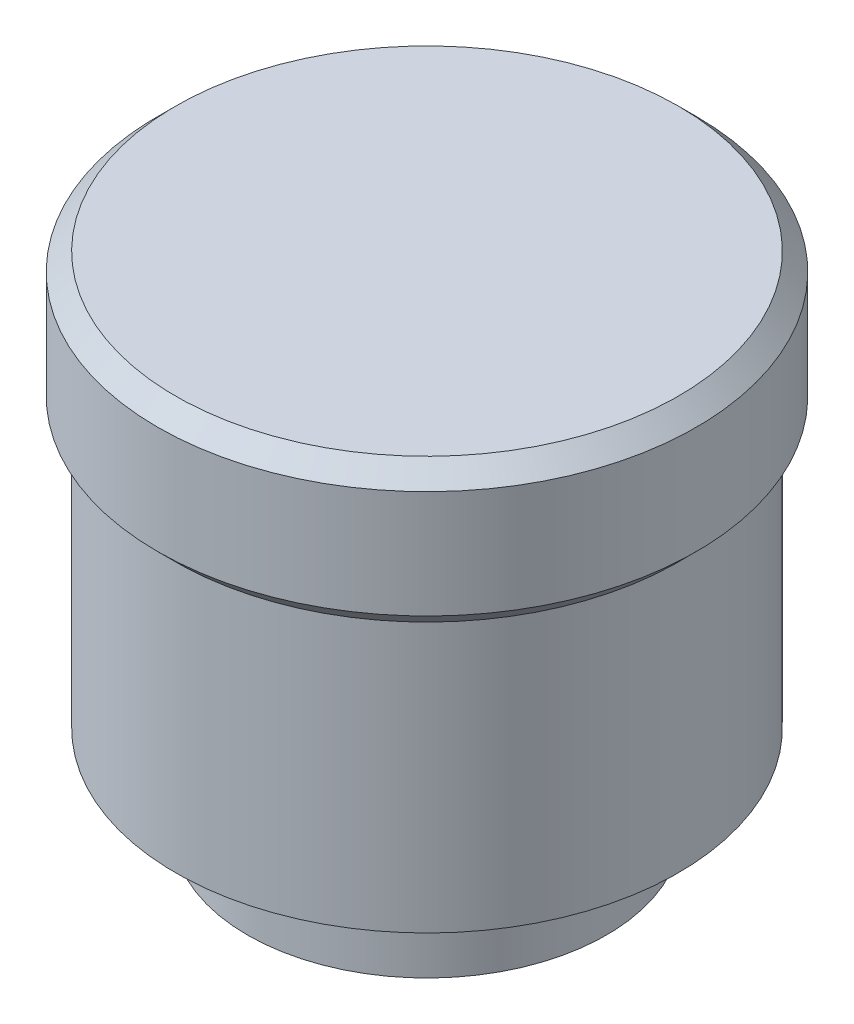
ISO-10303-21;
HEADER;
FILE_DESCRIPTION(('STEP AP214'),'2;1');
FILE_NAME('part.step','',(''),(''),'','','');
FILE_SCHEMA(('AUTOMOTIVE_DESIGN { 1 0 10303 214 1 1 1 1 }'));
ENDSEC;
DATA;
#1=APPLICATION_CONTEXT('core data for automotive mechanical design processes');
#2=APPLICATION_PROTOCOL_DEFINITION('international standard','automotive_design',2000,#1);
#3=PRODUCT_CONTEXT('',#1,'mechanical');
#4=PRODUCT('Part','Part','',(#3));
#5=PRODUCT_RELATED_PRODUCT_CATEGORY('part','',(#4));
#6=PRODUCT_DEFINITION_FORMATION('','',#4);
#7=PRODUCT_DEFINITION_CONTEXT('part definition',#1,'design');
#8=PRODUCT_DEFINITION('design','',#6,#7);
#9=PRODUCT_DEFINITION_SHAPE('','',#8);
#10=(LENGTH_UNIT() NAMED_UNIT(*) SI_UNIT(.MILLI.,.METRE.));
#11=(NAMED_UNIT(*) PLANE_ANGLE_UNIT() SI_UNIT($,.RADIAN.));
#12=(NAMED_UNIT(*) SI_UNIT($,.STERADIAN.) SOLID_ANGLE_UNIT());
#13=UNCERTAINTY_MEASURE_WITH_UNIT(LENGTH_MEASURE(1.E-05),#10,'distance_accuracy_value','');
#14=(GEOMETRIC_REPRESENTATION_CONTEXT(3) GLOBAL_UNCERTAINTY_ASSIGNED_CONTEXT((#13)) GLOBAL_UNIT_ASSIGNED_CONTEXT((#10,
#11,#12)) REPRESENTATION_CONTEXT('',''));
#15=CARTESIAN_POINT('',(0.,0.,0.));
#16=DIRECTION('',(0.,0.,1.));
#17=DIRECTION('',(1.,0.,0.));
#18=AXIS2_PLACEMENT_3D('',#15,#16,#17);
#19=CARTESIAN_POINT('',(0.,0.,-10.));
#20=DIRECTION('',(0.,-1.,0.));
#21=DIRECTION('',(0.,0.,-1.));
#22=AXIS2_PLACEMENT_3D('',#19,#20,#21);
#23=PLANE('',#22);
#24=CARTESIAN_POINT('',(0.,0.,-4.));
#25=DIRECTION('',(0.,-1.,0.));
#26=DIRECTION('',(0.,0.,-1.));
#27=AXIS2_PLACEMENT_3D('',#24,#25,#26);
#28=CIRCLE('',#27,1.65);
#29=CARTESIAN_POINT('',(0.,0.,-5.65));
#30=VERTEX_POINT('',#29);
#31=EDGE_CURVE('E54',#30,#30,#28,.T.);
#32=ORIENTED_EDGE('',*,*,#31,.F.);
#33=EDGE_LOOP('',(#32));
#34=FACE_BOUND('',#33,.T.);
#35=CARTESIAN_POINT('',(0.,0.,0.));
#36=DIRECTION('',(0.,-1.,0.));
#37=DIRECTION('',(0.,0.,-1.));
#38=AXIS2_PLACEMENT_3D('',#35,#36,#37);
#39=CIRCLE('',#38,10.);
#40=CARTESIAN_POINT('',(0.,0.,-10.));
#41=VERTEX_POINT('',#40);
#42=EDGE_CURVE('E53',#41,#41,#39,.T.);
#43=ORIENTED_EDGE('',*,*,#42,.T.);
#44=EDGE_LOOP('',(#43));
#45=FACE_BOUND('',#44,.T.);
#46=ADVANCED_FACE('F34',(#34,#45),#23,.T.);
#47=CARTESIAN_POINT('',(0.,28.,0.));
#48=DIRECTION('',(0.,1.,0.));
#49=DIRECTION('',(0.,0.,1.));
#50=AXIS2_PLACEMENT_3D('',#47,#48,#49);
#51=PLANE('',#50);
#52=CARTESIAN_POINT('',(0.,28.,0.));
#53=DIRECTION('',(0.,-1.,0.));
#54=DIRECTION('',(0.,0.,-1.));
#55=AXIS2_PLACEMENT_3D('',#52,#53,#54);
#56=CIRCLE('',#55,14.);
#57=CARTESIAN_POINT('',(0.,28.,-14.));
#58=VERTEX_POINT('',#57);
#59=EDGE_CURVE('E11',#58,#58,#56,.T.);
#60=ORIENTED_EDGE('',*,*,#59,.F.);
#61=EDGE_LOOP('',(#60));
#62=FACE_BOUND('',#61,.T.);
#63=ADVANCED_FACE('F80',(#62),#51,.T.);
#64=CARTESIAN_POINT('',(0.,27.,0.));
#65=DIRECTION('',(0.,-1.,0.));
#66=DIRECTION('',(0.,0.,-1.));
#67=AXIS2_PLACEMENT_3D('',#64,#65,#66);
#68=CONICAL_SURFACE('',#67,15.,0.785398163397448);
#69=ORIENTED_EDGE('',*,*,#59,.T.);
#70=EDGE_LOOP('',(#69));
#71=FACE_BOUND('',#70,.T.);
#72=CARTESIAN_POINT('',(0.,27.,0.));
#73=DIRECTION('',(0.,-1.,0.));
#74=DIRECTION('',(0.,0.,-1.));
#75=AXIS2_PLACEMENT_3D('',#72,#73,#74);
#76=CIRCLE('',#75,15.);
#77=CARTESIAN_POINT('',(0.,27.,-15.));
#78=VERTEX_POINT('',#77);
#79=EDGE_CURVE('E40',#78,#78,#76,.T.);
#80=ORIENTED_EDGE('',*,*,#79,.F.);
#81=EDGE_LOOP('',(#80));
#82=FACE_BOUND('',#81,.T.);
#83=ADVANCED_FACE('F78',(#71,#82),#68,.T.);
#84=CARTESIAN_POINT('',(0.,0.,0.));
#85=DIRECTION('',(0.,-1.,0.));
#86=DIRECTION('',(0.,0.,-1.));
#87=AXIS2_PLACEMENT_3D('',#84,#85,#86);
#88=CYLINDRICAL_SURFACE('',#87,15.);
#89=ORIENTED_EDGE('',*,*,#79,.T.);
#90=EDGE_LOOP('',(#89));
#91=FACE_BOUND('',#90,.T.);
#92=CARTESIAN_POINT('',(0.,21.,0.));
#93=DIRECTION('',(0.,-1.,0.));
#94=DIRECTION('',(0.,0.,-1.));
#95=AXIS2_PLACEMENT_3D('',#92,#93,#94);
#96=CIRCLE('',#95,15.);
#97=CARTESIAN_POINT('',(0.,21.,-15.));
#98=VERTEX_POINT('',#97);
#99=EDGE_CURVE('E70',#98,#98,#96,.T.);
#100=ORIENTED_EDGE('',*,*,#99,.F.);
#101=EDGE_LOOP('',(#100));
#102=FACE_BOUND('',#101,.T.);
#103=ADVANCED_FACE('F75',(#91,#102),#88,.T.);
#104=CARTESIAN_POINT('',(0.,20.,0.));
#105=DIRECTION('',(0.,1.,0.));
#106=DIRECTION('',(0.,0.,1.));
#107=AXIS2_PLACEMENT_3D('',#104,#105,#106);
#108=CONICAL_SURFACE('',#107,14.,0.785398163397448);
#109=ORIENTED_EDGE('',*,*,#99,.T.);
#110=EDGE_LOOP('',(#109));
#111=FACE_BOUND('',#110,.T.);
#112=CARTESIAN_POINT('',(0.,20.,0.));
#113=DIRECTION('',(0.,-1.,0.));
#114=DIRECTION('',(0.,0.,-1.));
#115=AXIS2_PLACEMENT_3D('',#112,#113,#114);
#116=CIRCLE('',#115,14.);
#117=CARTESIAN_POINT('',(0.,20.,-14.));
#118=VERTEX_POINT('',#117);
#119=EDGE_CURVE('E67',#118,#118,#116,.T.);
#120=ORIENTED_EDGE('',*,*,#119,.F.);
#121=EDGE_LOOP('',(#120));
#122=FACE_BOUND('',#121,.T.);
#123=ADVANCED_FACE('F87',(#111,#122),#108,.T.);
#124=CARTESIAN_POINT('',(0.,0.,0.));
#125=DIRECTION('',(0.,-1.,0.));
#126=DIRECTION('',(0.,0.,-1.));
#127=AXIS2_PLACEMENT_3D('',#124,#125,#126);
#128=CYLINDRICAL_SURFACE('',#127,14.);
#129=ORIENTED_EDGE('',*,*,#119,.T.);
#130=EDGE_LOOP('',(#129));
#131=FACE_BOUND('',#130,.T.);
#132=CARTESIAN_POINT('',(0.,5.,0.));
#133=DIRECTION('',(0.,-1.,0.));
#134=DIRECTION('',(0.,0.,-1.));
#135=AXIS2_PLACEMENT_3D('',#132,#133,#134);
#136=CIRCLE('',#135,14.);
#137=CARTESIAN_POINT('',(0.,5.,-14.));
#138=VERTEX_POINT('',#137);
#139=EDGE_CURVE('E64',#138,#138,#136,.T.);
#140=ORIENTED_EDGE('',*,*,#139,.F.);
#141=EDGE_LOOP('',(#140));
#142=FACE_BOUND('',#141,.T.);
#143=ADVANCED_FACE('F105',(#131,#142),#128,.T.);
#144=CARTESIAN_POINT('',(0.,5.,-14.));
#145=DIRECTION('',(0.,-1.,0.));
#146=DIRECTION('',(0.,0.,-1.));
#147=AXIS2_PLACEMENT_3D('',#144,#145,#146);
#148=PLANE('',#147);
#149=ORIENTED_EDGE('',*,*,#139,.T.);
#150=EDGE_LOOP('',(#149));
#151=FACE_BOUND('',#150,.T.);
#152=CARTESIAN_POINT('',(0.,5.,0.));
#153=DIRECTION('',(0.,-1.,0.));
#154=DIRECTION('',(0.,0.,-1.));
#155=AXIS2_PLACEMENT_3D('',#152,#153,#154);
#156=CIRCLE('',#155,10.);
#157=CARTESIAN_POINT('',(0.,5.,-10.));
#158=VERTEX_POINT('',#157);
#159=EDGE_CURVE('E57',#158,#158,#156,.T.);
#160=ORIENTED_EDGE('',*,*,#159,.F.);
#161=EDGE_LOOP('',(#160));
#162=FACE_BOUND('',#161,.T.);
#163=ADVANCED_FACE('F99',(#151,#162),#148,.T.);
#164=CARTESIAN_POINT('',(0.,0.,0.));
#165=DIRECTION('',(0.,-1.,0.));
#166=DIRECTION('',(0.,0.,-1.));
#167=AXIS2_PLACEMENT_3D('',#164,#165,#166);
#168=CYLINDRICAL_SURFACE('',#167,10.);
#169=ORIENTED_EDGE('',*,*,#159,.T.);
#170=EDGE_LOOP('',(#169));
#171=FACE_BOUND('',#170,.T.);
#172=ORIENTED_EDGE('',*,*,#42,.F.);
#173=EDGE_LOOP('',(#172));
#174=FACE_BOUND('',#173,.T.);
#175=ADVANCED_FACE('F47',(#171,#174),#168,.T.);
#176=CARTESIAN_POINT('',(0.,16.,-4.));
#177=DIRECTION('',(0.,-1.,0.));
#178=DIRECTION('',(0.,0.,-1.));
#179=AXIS2_PLACEMENT_3D('',#176,#177,#178);
#180=CONICAL_SURFACE('',#179,1.65,1.02974425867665);
#181=CARTESIAN_POINT('',(0.,16.9914200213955,-4.));
#182=VERTEX_POINT('',#181);
#183=VERTEX_LOOP('',#182);
#184=FACE_BOUND('',#183,.T.);
#185=CARTESIAN_POINT('',(0.,16.,-4.));
#186=DIRECTION('',(0.,-1.,0.));
#187=DIRECTION('',(0.,0.,-1.));
#188=AXIS2_PLACEMENT_3D('',#185,#186,#187);
#189=CIRCLE('',#188,1.65);
#190=CARTESIAN_POINT('',(0.,16.,-5.65));
#191=VERTEX_POINT('',#190);
#192=EDGE_CURVE('E51',#191,#191,#189,.T.);
#193=ORIENTED_EDGE('',*,*,#192,.T.);
#194=EDGE_LOOP('',(#193));
#195=FACE_BOUND('',#194,.T.);
#196=ADVANCED_FACE('F43',(#184,#195),#180,.F.);
#197=CARTESIAN_POINT('',(0.,0.,-4.));
#198=DIRECTION('',(0.,-1.,0.));
#199=DIRECTION('',(0.,0.,-1.));
#200=AXIS2_PLACEMENT_3D('',#197,#198,#199);
#201=CYLINDRICAL_SURFACE('',#200,1.65);
#202=ORIENTED_EDGE('',*,*,#192,.F.);
#203=EDGE_LOOP('',(#202));
#204=FACE_BOUND('',#203,.T.);
#205=ORIENTED_EDGE('',*,*,#31,.T.);
#206=EDGE_LOOP('',(#205));
#207=FACE_BOUND('',#206,.T.);
#208=ADVANCED_FACE('F46',(#204,#207),#201,.F.);
#209=CLOSED_SHELL('',(#46,#63,#83,#103,#123,#143,#163,#175,#196,#208));
#210=MANIFOLD_SOLID_BREP('B2',#209);
#211=ADVANCED_BREP_SHAPE_REPRESENTATION('',(#18,#210),#14);
#212=SHAPE_DEFINITION_REPRESENTATION(#9,#211);
ENDSEC;
END-ISO-10303-21;
